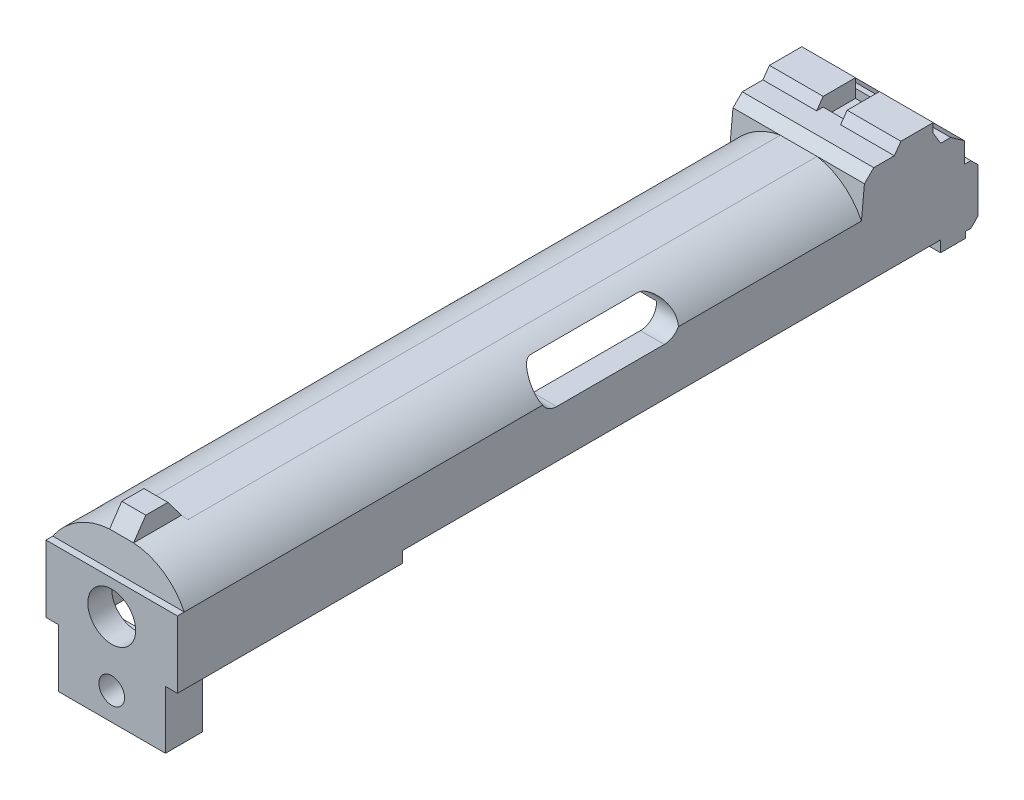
from build123d import *

# Parameters (mm, degrees)
BOSS_EXTRUDE1_DEPTH = 27.94
SKETCH3_W           = 17.78
SKETCH3_H           = 157.355176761
CUT_EXTRUDE1_DEPTH  = 16.256
SKETCH4_R           = 5.08
CUT_EXTRUDE2_DEPTH  = 16.256
SKETCH6_W           = 5.098292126
SKETCH6_H           = 6.873527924
SKETCH6_W_2         = 11.420853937
SKETCH6_H_2         = 9.817993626
CUT_EXTRUDE4_DEPTH  = 3.81
SKETCH7_W           = 11.420853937
SKETCH7_H           = 3.81
CUT_EXTRUDE5_DEPTH  = 18.034
CUT_EXTRUDE6_DEPTH  = 143.93478078
SKETCH10_W          = 5.098292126
SKETCH10_H          = 2.416899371
CUT_EXTRUDE7_DEPTH  = 140.462
CUT_EXTRUDE8_DEPTH  = 140.462
CUT_EXTRUDE9_DEPTH  = 11.938
BOSS_EXTRUDE2_DEPTH = 7.874
SKETCH21_R          = 1.905
BOSS_EXTRUDE3_DEPTH = 8.128
CUT_EXTRUDE10_REACH = 210.708
SKETCH22_R          = 2.7305
SKETCH24_W          = 114.3
SKETCH24_H          = 2.363586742
CUT_EXTRUDE11_DEPTH = 64.77


with BuildPart() as part:
    # Sketch1 → Boss-Extrude1 (new body)
    with BuildSketch(Plane(origin=(0, 0, 0), x_dir=(0, 0, -1), z_dir=(1, 0, 0))):
        Polygon((-81.39618337, 92.837732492), (-248.261436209, 92.837732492), (-248.261436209, 107.083787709), (-246.812688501, 107.083787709), (-245.797033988, 117.578884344), (-235.979040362, 117.578884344), (-235.979040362, 113.629116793), (-102.244488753, 113.629116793), (-100.269604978, 115.604000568), (-95.887382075, 115.604000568), (-94.494099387, 117.578884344), (-87.620571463, 117.578884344), (-87.620571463, 115.604000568), (-86.041517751, 112.980208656), (-83.905150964, 112.980208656), (-80.986939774, 110.921407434), (-80.986939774, 106.570645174), (-79.614490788, 106.570645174), (-78.103895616, 105.060050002), (-78.103895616, 95.616366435), (-79.614490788, 94.105771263), (-80.746259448, 94.105771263), (-80.746259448, 92.837732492), align=None)
    extrude(amount=BOSS_EXTRUDE1_DEPTH)

    # Sketch3 → Cut-Extrude1 (cut)
    with BuildSketch(Plane.XZ.offset(-92.837732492)):
        with Locations((13.97, 164.503847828)):
            Rectangle(SKETCH3_W, SKETCH3_H)
    extrude(amount=-CUT_EXTRUDE1_DEPTH, mode=Mode.SUBTRACT)

    # Sketch4 → Cut-Extrude2 (cut)
    with BuildSketch(Plane.XY.offset(248.261436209)):
        with Locations((13.97, 99.960760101)):
            Circle(SKETCH4_R)
    extrude(amount=-CUT_EXTRUDE2_DEPTH, mode=Mode.SUBTRACT)

    # Sketch6 → Cut-Extrude4 (cut)
    with BuildSketch(Plane(origin=(0, 117.578884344, 0), x_dir=(1, 0, 0), z_dir=(0, 1, 0))):
        with Locations((13.97, -91.057335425)):
            Rectangle(SKETCH6_W, SKETCH6_H)
        with Locations((5.710426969, -240.888037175)):
            Rectangle(SKETCH6_W_2, SKETCH6_H_2)
        with Locations((22.229573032, -240.888037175)):
            Rectangle(SKETCH6_W_2, SKETCH6_H_2)
    extrude(amount=-CUT_EXTRUDE4_DEPTH, mode=Mode.SUBTRACT)

    # Sketch7 → Cut-Extrude5 (cut)
    with BuildSketch(Plane.XY.offset(248.261436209)):
        Polygon((11.420853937, 117.578884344), (11.420853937, 113.768884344), (0, 113.629116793), (0, 117.578884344), align=None)
        with Locations((22.229573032, 115.673884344)):
            Rectangle(SKETCH7_W, SKETCH7_H)
    extrude(amount=-CUT_EXTRUDE5_DEPTH, mode=Mode.SUBTRACT)

    # Sketch8 → Cut-Extrude6 (cut, along a direction that is not the sketch's normal)
    with BuildSketch(Plane(origin=(0, 24.657045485, 254.789470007), x_dir=(1, 0, 0), z_dir=(0, 0.09632419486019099, 0.9953500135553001))):
        with BuildLine():
            Line((11.420853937, 89.528143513), (0, 89.387723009))
            Line((0, 89.387723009), (0, 82.811816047))
            ThreePointArc((0, 82.811816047), (4.896653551, 87.553769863), (11.420853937, 89.528143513))
        make_face()
        with BuildLine():
            Line((16.519146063, 89.528143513), (27.94, 89.528143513))
            Line((27.94, 89.528143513), (27.94, 82.811816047))
            ThreePointArc((27.94, 82.811816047), (23.043346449, 87.553769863), (16.519146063, 89.528143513))
        make_face()
    extrude(amount=-CUT_EXTRUDE6_DEPTH, dir=(0, 0, 1), mode=Mode.SUBTRACT)

    # Sketch10 → Cut-Extrude7 (cut, along a direction that is not the sketch's normal)
    with BuildSketch(Plane(origin=(0, 83.585353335, 118.476573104), x_dir=(1, 0, 0), z_dir=(0, 0.5764752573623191, 0.817114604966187))):
        with Locations((13.97, 40.393463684)):
            Rectangle(SKETCH10_W, SKETCH10_H)
    extrude(amount=-CUT_EXTRUDE7_DEPTH, dir=(0, 0, 1), mode=Mode.SUBTRACT)

    # Sketch11 → Cut-Extrude8 (cut)
    with BuildSketch(Plane(origin=(16.519146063, 0, 0), x_dir=(0, 0, -1), z_dir=(1, 0, 0))):
        Polygon((-246.165743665, 113.768884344), (-243.57320389, 117.578884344), (-245.797033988, 117.578884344), align=None)
        Polygon((-238.868086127, 117.578884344), (-235.979040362, 113.768884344), (-235.979040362, 117.578884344), align=None)
    extrude(amount=-CUT_EXTRUDE8_DEPTH, mode=Mode.SUBTRACT)

    # Sketch14 → Cut-Extrude9 (cut)
    with BuildSketch(Plane(origin=(27.94, 0, 0), x_dir=(0, 0, -1), z_dir=(1, 0, 0))):
        with BuildLine():
            Line((-167.638268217, 112.155258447), (-144.778268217, 112.155258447))
            ThreePointArc((-144.778268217, 112.155258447), (-141.360760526, 108.737750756), (-144.778268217, 105.320243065))
            Line((-144.778268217, 105.320243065), (-167.638268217, 105.320243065))
            ThreePointArc((-167.638268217, 105.320243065), (-171.055775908, 108.737750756), (-167.638268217, 112.155258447))
        make_face()
    extrude(amount=-CUT_EXTRUDE9_DEPTH, mode=Mode.SUBTRACT)

    # 3DSketch2 → Boss-Extrude2 (add)
    with BuildSketch(Plane(origin=(13.97, 80.518732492, 248.261436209), x_dir=(0.6797760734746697, 0.7334197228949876, 0), z_dir=(0, 0, 1))):
        Polygon((0, 0), (-7.696500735, 8.303860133), (1.338496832, 16.678021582), (16.796657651, 0), (7.761660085, -8.374161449), align=None)
    extrude(amount=-BOSS_EXTRUDE2_DEPTH)

    # Sketch21 → Boss-Extrude3 (add)
    with BuildSketch(Plane(origin=(0, 0, 240.387436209), x_dir=(-1, 0, 0), z_dir=(0, 0, -1))):
        with Locations(Location((-13.97, 87.173532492, 0), (0, 0, 90))):
            Circle(SKETCH21_R)
    extrude(amount=BOSS_EXTRUDE3_DEPTH)

    # Sketch22 → Cut-Extrude10 (cut, up to next)
    with BuildSketch(Plane.XY.offset(248.261436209), mode=Mode.PRIVATE) as cut_extrude10_sk1:
        with Locations((13.97, 86.371760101)):
            Circle(SKETCH22_R)
    cut_extrude10_tool1 = extrude(cut_extrude10_sk1.sketch, amount=-CUT_EXTRUDE10_REACH, mode=Mode.PRIVATE) & part.part
    add(cut_extrude10_tool1.solids().sort_by_distance((13.97, 86.37176, 248.261436))[0], mode=Mode.SUBTRACT)

    # Sketch24 → Cut-Extrude11 (cut)
    with BuildSketch(Plane.ZY):
        with Locations((143.227901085, 94.019525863)):
            Rectangle(SKETCH24_W, SKETCH24_H)
    extrude(amount=-CUT_EXTRUDE11_DEPTH, mode=Mode.SUBTRACT)


solid = part.part
